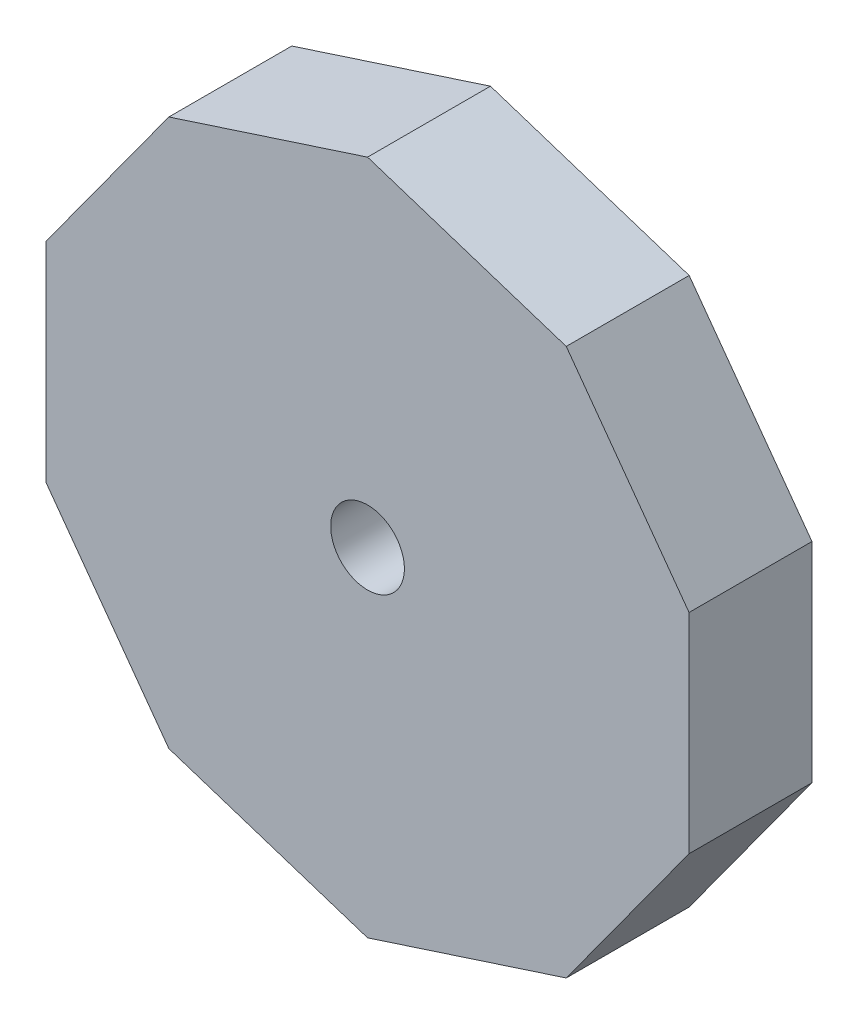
from build123d import *

# Parameters (mm, degrees)
SKETCH_1_R      = 6
EXTRUDE_1_DEPTH = 20


with BuildPart() as part:
    # Sketch 1 → Extrude 1 (new body)
    with BuildSketch(Plane.XY):
        Polygon((52.320620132, 17), (32.335921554, 44.506577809), (0, 55.013155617), (-32.335921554, 44.506577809), (-52.320620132, 17), (-52.320620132, -17), (-32.335921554, -44.506577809), (0, -55.013155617), (32.335921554, -44.506577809), (52.320620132, -17), align=None)
        Circle(SKETCH_1_R, mode=Mode.SUBTRACT)
    extrude(amount=EXTRUDE_1_DEPTH)


solid = part.part
